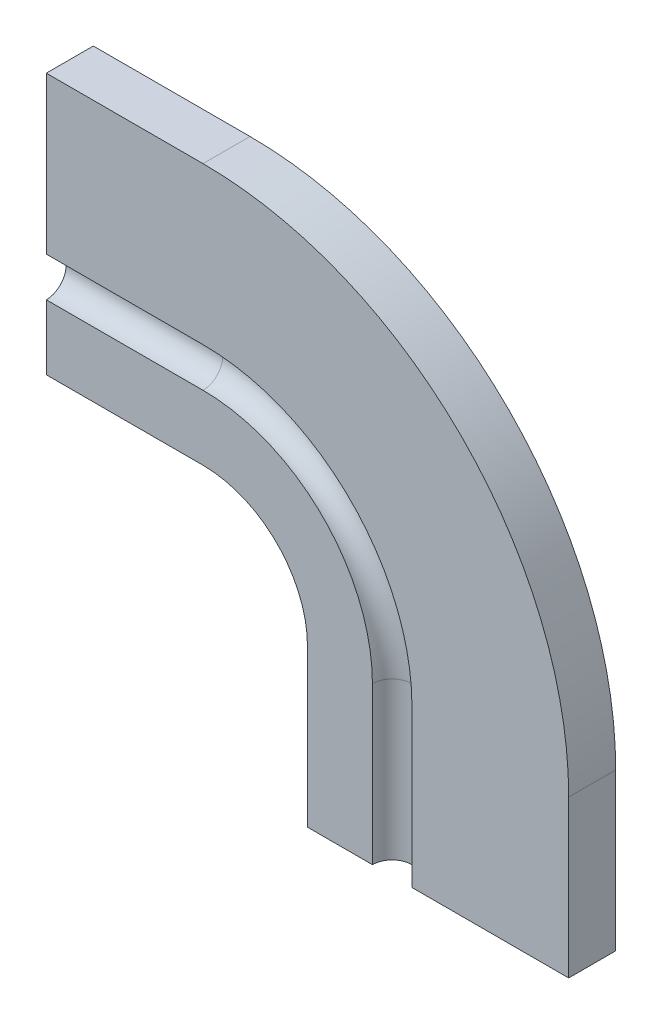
from build123d import *


with BuildPart() as part:
    # Sweep1: sweep along a path in Sketch1
    with BuildLine(Plane.XY) as sweep1_path:
        Line((50, -50), (50, -20))
        ThreePointArc((50, -20), (44.142135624, -5.857864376), (30, 0))
        Line((30, 0), (0, 0))
    # Sketch2 → Sweep1 (sweep)
    with BuildSketch(Plane(origin=(0, 0, 0), x_dir=(0, 0, -1), z_dir=(1, 0, 0))):
        with BuildLine():
            Line((0, 0), (0, 12.428))
            ThreePointArc((0, 12.428), (3.786, 16.214), (0, 20))
            Line((0, 20), (0, 50))
            Line((0, 50), (9, 50))
            Line((9, 50), (9, 48.786))
            Line((9, 48.786), (1.214, 48.786))
            Line((1.214, 48.786), (1.214, 21.064381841))
            ThreePointArc((1.214, 21.064381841), (5, 16.214), (1.214, 11.363618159))
            Line((1.214, 11.363618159), (1.214, 1.214))
            Line((1.214, 1.214), (9, 1.214))
            Line((9, 1.214), (9, 0))
            Line((9, 0), (0, 0))
        make_face()
    sweep(path=sweep1_path.line)


solid = part.part
